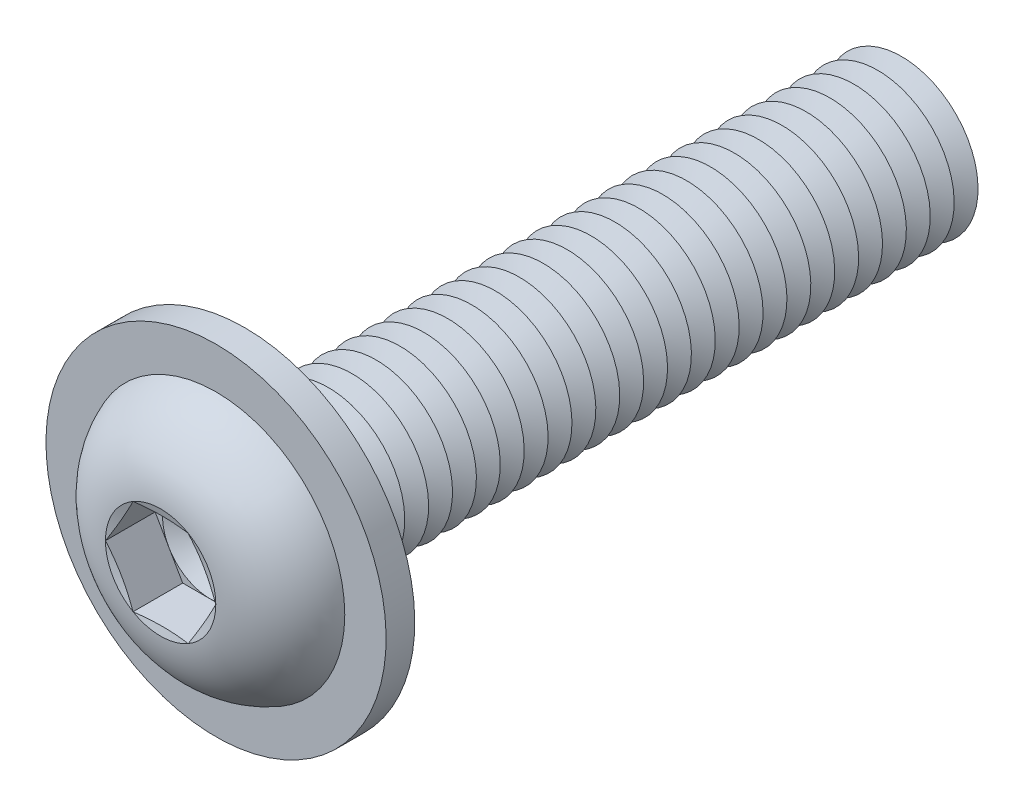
from build123d import *

# Parameters (mm, degrees)
FILLET1_R           = 0.625
LPATTERN1_COUNT     = 28
LPATTERN1_PITCH     = 1.25
CUT_EXTRUDE1_DEPTH  = 2.6
SKETCH5_R           = 8.9
SKETCH5_R_2         = 4.625
BOSS_EXTRUDE1_DEPTH = 1.5


with BuildPart() as part:
    # Sketch1 → Revolve1 (revolve)
    with BuildSketch(Plane(origin=(0, 0, 0), x_dir=(0, 0, -1), z_dir=(1, 0, 0))):
        with BuildLine():
            Line((0, 4), (0, 7))
            ThreePointArc((0, 7), (-3.011595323, 5.81154966), (-4.4, 2.88675))
            Line((-4.4, 2.88675), (-4.013248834, 1.443375))
            Line((-4.013248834, 1.443375), (-4.4, 1.443375))
            Line((-4.4, 1.443375), (-4.4, 0))
            Line((-4.4, 0), (35, 0))
            Line((35, 0), (35, 4))
            Line((35, 4), (0, 4))
        make_face()
    revolve(axis=Axis((0, 0, -35), (0, 0, 1)))

    # Fillet1
    fillet1_edges = [part.edges().sort_by_distance(p)[0] for p in [
        (0, -4, 0),
    ]]
    fillet(fillet1_edges, radius=FILLET1_R)

    # Sketch2 → Cut-Revolve1 (revolve, cut)
    with BuildSketch(Plane(origin=(0, 0, 0), x_dir=(0, 0, -1), z_dir=(1, 0, 0))):
        Polygon((34.375, 4), (35.625, 4), (35, 2.917468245), align=None)
    cut_revolve1 = revolve(axis=Axis((0, 0, -35), (0, 0, -1)), mode=Mode.SUBTRACT)

    # LPattern1: Cut-Revolve1 ×28
    with Locations(*[(0, 0, i * LPATTERN1_PITCH) for i in range(1, LPATTERN1_COUNT)]):
        add(cut_revolve1, mode=Mode.SUBTRACT)

    # Sketch3 → Cut-Extrude1 (cut)
    with BuildSketch(Plane.XY.offset(4.4)):
        Polygon((1.443375, 2.499998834), (-1.443375, 2.499998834), (-2.88675, 0), (-1.443375, -2.499998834), (1.443375, -2.499998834), (2.88675, 0), align=None)
    extrude(amount=-CUT_EXTRUDE1_DEPTH, mode=Mode.SUBTRACT)

    # Cut-Extrude2 cone 1 section (on through the dimple's axis) → Cut-Extrude2 (revolve, cut)
    with BuildSketch(Plane(origin=(0, 0, 1.8), x_dir=(0, -1, 0), z_dir=(1, 0, 0))):
        Polygon((0, 0), (2.499998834, 0), (0, 1.443375), align=None)
    revolve(axis=Axis((0, 0, 1.8), (0, 0, -1)), mode=Mode.SUBTRACT)

    # Sketch5 → Boss-Extrude1 (add)
    with BuildSketch(Plane(origin=(0, 0, 0), x_dir=(-1, 0, 0), z_dir=(0, 0, -1))):
        with Locations(Location((0, 0, 0), (0, 0, 90))):
            Circle(SKETCH5_R)
        Circle(SKETCH5_R_2, mode=Mode.SUBTRACT)
    extrude(amount=-BOSS_EXTRUDE1_DEPTH)


solid = part.part
